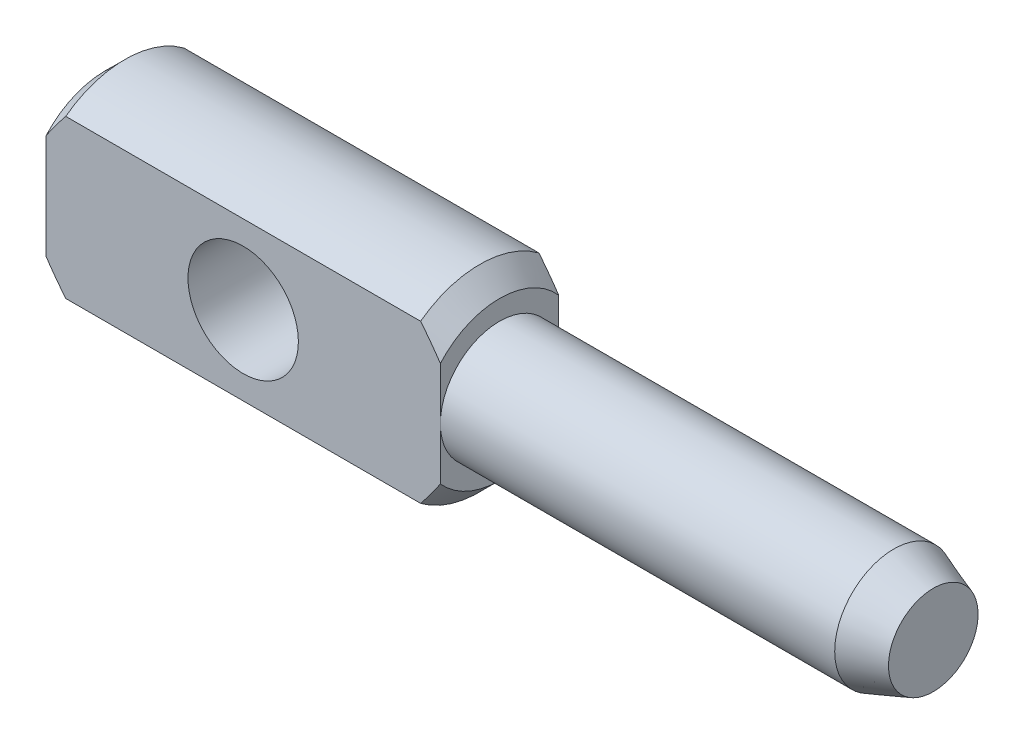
from build123d import *

# Parameters (mm, degrees)
SKETCH2_OUTSIDE_W   = 11.432
SKETCH2_OUTSIDE_H   = 11.432
SKETCH2_OUTSIDE_W_2 = 3
SKETCH2_OUTSIDE_H_2 = 5
CUT_EXTRUDE1_DEPTH  = 19
SKETCH4_R           = 1.4
CUT_EXTRUDE2_DEPTH  = 22.360009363


with BuildPart() as part:
    # Sketch1 → Revolve1 (revolve)
    with BuildSketch(Plane.XY, mode=Mode.PRIVATE) as revolve1_sk:
        Polygon((0, 0), (0, 2), (0.5, 2.5), (9.5, 2.5), (10, 2), (10, 1.5), (20, 1.5), (21, 1.136029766), (21, 0), align=None)
    revolve(revolve1_sk.sketch.rotate(Axis((0, 0, 0), (1, 0, 0)), 90), axis=Axis((0, 0, 0), (1, 0, 0)))

    # Sketch2 outside → Cut-Extrude1 (cut)
    with BuildSketch(Plane.ZY):
        Rectangle(SKETCH2_OUTSIDE_W, SKETCH2_OUTSIDE_H)
        Rectangle(SKETCH2_OUTSIDE_W_2, SKETCH2_OUTSIDE_H_2, mode=Mode.SUBTRACT)
    extrude(amount=-CUT_EXTRUDE1_DEPTH, mode=Mode.SUBTRACT)

    # Sketch4 → Cut-Extrude2 (cut, through all)
    with BuildSketch(Plane.XY.offset(1.5)):
        with Locations((5, 0)):
            Circle(SKETCH4_R)
    extrude(amount=-CUT_EXTRUDE2_DEPTH, mode=Mode.SUBTRACT)


solid = part.part
